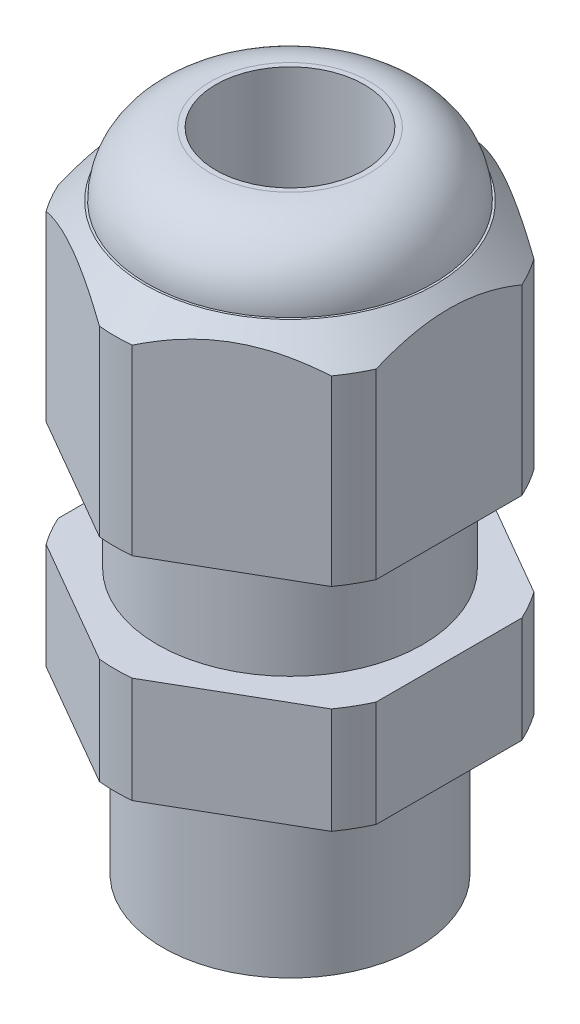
ISO-10303-21;
HEADER;
FILE_DESCRIPTION(('STEP AP214'),'2;1');
FILE_NAME('part.step','',(''),(''),'','','');
FILE_SCHEMA(('AUTOMOTIVE_DESIGN { 1 0 10303 214 1 1 1 1 }'));
ENDSEC;
DATA;
#1=APPLICATION_CONTEXT('core data for automotive mechanical design processes');
#2=APPLICATION_PROTOCOL_DEFINITION('international standard','automotive_design',2000,#1);
#3=PRODUCT_CONTEXT('',#1,'mechanical');
#4=PRODUCT('Part','Part','',(#3));
#5=PRODUCT_RELATED_PRODUCT_CATEGORY('part','',(#4));
#6=PRODUCT_DEFINITION_FORMATION('','',#4);
#7=PRODUCT_DEFINITION_CONTEXT('part definition',#1,'design');
#8=PRODUCT_DEFINITION('design','',#6,#7);
#9=PRODUCT_DEFINITION_SHAPE('','',#8);
#10=(LENGTH_UNIT() NAMED_UNIT(*) SI_UNIT(.MILLI.,.METRE.));
#11=(NAMED_UNIT(*) PLANE_ANGLE_UNIT() SI_UNIT($,.RADIAN.));
#12=(NAMED_UNIT(*) SI_UNIT($,.STERADIAN.) SOLID_ANGLE_UNIT());
#13=UNCERTAINTY_MEASURE_WITH_UNIT(LENGTH_MEASURE(1.E-05),#10,'distance_accuracy_value','');
#14=(GEOMETRIC_REPRESENTATION_CONTEXT(3) GLOBAL_UNCERTAINTY_ASSIGNED_CONTEXT((#13)) GLOBAL_UNIT_ASSIGNED_CONTEXT((#10,
#11,#12)) REPRESENTATION_CONTEXT('',''));
#15=CARTESIAN_POINT('',(0.,0.,0.));
#16=DIRECTION('',(0.,0.,1.));
#17=DIRECTION('',(1.,0.,0.));
#18=AXIS2_PLACEMENT_3D('',#15,#16,#17);
#19=CARTESIAN_POINT('',(-1.66533453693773E-13,0.,0.));
#20=DIRECTION('',(0.,-1.,0.));
#21=DIRECTION('',(0.,0.,-1.));
#22=AXIS2_PLACEMENT_3D('',#19,#20,#21);
#23=CYLINDRICAL_SURFACE('',#22,8.25);
#24=CARTESIAN_POINT('',(0.,17.5000000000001,0.));
#25=DIRECTION('',(0.,-1.,0.));
#26=DIRECTION('',(0.,0.,-1.));
#27=AXIS2_PLACEMENT_3D('',#24,#25,#26);
#28=CIRCLE('',#27,8.25);
#29=CARTESIAN_POINT('',(0.773529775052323,17.5000000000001,8.21365641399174));
#30=VERTEX_POINT('',#29);
#31=CARTESIAN_POINT('',(-0.773529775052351,17.5000000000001,8.21365641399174));
#32=VERTEX_POINT('',#31);
#33=EDGE_CURVE('E355',#30,#32,#28,.T.);
#34=ORIENTED_EDGE('',*,*,#33,.F.);
#35=DIRECTION('',(0.,-1.,0.));
#36=VECTOR('',#35,1.);
#37=CARTESIAN_POINT('',(0.77352977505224,0.,8.21365641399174));
#38=LINE('',#37,#36);
#39=CARTESIAN_POINT('',(0.773529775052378,26.1000000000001,8.21365641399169));
#40=VERTEX_POINT('',#39);
#41=EDGE_CURVE('E399',#30,#40,#38,.F.);
#42=ORIENTED_EDGE('',*,*,#41,.T.);
#43=CARTESIAN_POINT('',(-2.22044604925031E-13,26.1000000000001,0.));
#44=DIRECTION('',(0.,1.,0.));
#45=DIRECTION('',(0.,0.,1.));
#46=AXIS2_PLACEMENT_3D('',#43,#44,#45);
#47=CIRCLE('',#46,8.25);
#48=CARTESIAN_POINT('',(-0.773529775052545,26.1000000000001,8.21365641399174));
#49=VERTEX_POINT('',#48);
#50=EDGE_CURVE('E237',#40,#49,#47,.F.);
#51=ORIENTED_EDGE('',*,*,#50,.T.);
#52=DIRECTION('',(0.,-1.,0.));
#53=VECTOR('',#52,1.);
#54=CARTESIAN_POINT('',(-0.773529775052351,0.,8.21365641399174));
#55=LINE('',#54,#53);
#56=EDGE_CURVE('E422',#49,#32,#55,.T.);
#57=ORIENTED_EDGE('',*,*,#56,.T.);
#58=EDGE_LOOP('',(#34,#42,#51,#57));
#59=FACE_BOUND('',#58,.T.);
#60=ADVANCED_FACE('F44',(#59),#23,.T.);
#61=CARTESIAN_POINT('',(7.49999999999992,26.1,3.43693177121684));
#62=VERTEX_POINT('',#61);
#63=CARTESIAN_POINT('',(6.72647022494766,26.1000000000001,4.7767246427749));
#64=VERTEX_POINT('',#63);
#65=EDGE_CURVE('E229',#62,#64,#47,.F.);
#66=ORIENTED_EDGE('',*,*,#65,.T.);
#67=DIRECTION('',(0.,-1.,0.));
#68=VECTOR('',#67,1.);
#69=CARTESIAN_POINT('',(6.72647022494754,0.,4.77672464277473));
#70=LINE('',#69,#68);
#71=CARTESIAN_POINT('',(6.72647022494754,17.5000000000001,4.7767246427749));
#72=VERTEX_POINT('',#71);
#73=EDGE_CURVE('E402',#64,#72,#70,.T.);
#74=ORIENTED_EDGE('',*,*,#73,.T.);
#75=CARTESIAN_POINT('',(7.50000000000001,17.5,3.43693177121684));
#76=VERTEX_POINT('',#75);
#77=EDGE_CURVE('E231',#76,#72,#28,.T.);
#78=ORIENTED_EDGE('',*,*,#77,.F.);
#79=DIRECTION('',(0.,-1.,0.));
#80=VECTOR('',#79,1.);
#81=CARTESIAN_POINT('',(7.49999999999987,0.,3.43693177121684));
#82=LINE('',#81,#80);
#83=EDGE_CURVE('E213',#76,#62,#82,.F.);
#84=ORIENTED_EDGE('',*,*,#83,.T.);
#85=EDGE_LOOP('',(#66,#74,#78,#84));
#86=FACE_BOUND('',#85,.T.);
#87=ADVANCED_FACE('F227',(#86),#23,.T.);
#88=CARTESIAN_POINT('',(-6.72647022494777,17.5000000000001,4.7767246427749));
#89=VERTEX_POINT('',#88);
#90=CARTESIAN_POINT('',(-7.50000000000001,17.5000000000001,3.43693177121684));
#91=VERTEX_POINT('',#90);
#92=EDGE_CURVE('E363',#89,#91,#28,.T.);
#93=ORIENTED_EDGE('',*,*,#92,.F.);
#94=DIRECTION('',(0.,-1.,0.));
#95=VECTOR('',#94,1.);
#96=CARTESIAN_POINT('',(-6.72647022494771,0.,4.7767246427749));
#97=LINE('',#96,#95);
#98=CARTESIAN_POINT('',(-6.72647022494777,26.1000000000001,4.77672464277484));
#99=VERTEX_POINT('',#98);
#100=EDGE_CURVE('E419',#89,#99,#97,.F.);
#101=ORIENTED_EDGE('',*,*,#100,.T.);
#102=CARTESIAN_POINT('',(-7.50000000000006,26.1000000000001,3.43693177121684));
#103=VERTEX_POINT('',#102);
#104=EDGE_CURVE('E242',#99,#103,#47,.F.);
#105=ORIENTED_EDGE('',*,*,#104,.T.);
#106=DIRECTION('',(0.,-1.,0.));
#107=VECTOR('',#106,1.);
#108=CARTESIAN_POINT('',(-7.50000000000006,0.,3.43693177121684));
#109=LINE('',#108,#107);
#110=EDGE_CURVE('E440',#103,#91,#109,.T.);
#111=ORIENTED_EDGE('',*,*,#110,.T.);
#112=EDGE_LOOP('',(#93,#101,#105,#111));
#113=FACE_BOUND('',#112,.T.);
#114=ADVANCED_FACE('F326',(#113),#23,.T.);
#115=CARTESIAN_POINT('',(-7.50000000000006,17.5000000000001,-3.43693177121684));
#116=VERTEX_POINT('',#115);
#117=CARTESIAN_POINT('',(-6.72647022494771,17.5,-4.7767246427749));
#118=VERTEX_POINT('',#117);
#119=EDGE_CURVE('E358',#116,#118,#28,.T.);
#120=ORIENTED_EDGE('',*,*,#119,.F.);
#121=DIRECTION('',(0.,-1.,0.));
#122=VECTOR('',#121,1.);
#123=CARTESIAN_POINT('',(-7.50000000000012,0.,-3.43693177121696));
#124=LINE('',#123,#122);
#125=CARTESIAN_POINT('',(-7.50000000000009,26.1000000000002,-3.43693177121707));
#126=VERTEX_POINT('',#125);
#127=EDGE_CURVE('E437',#116,#126,#124,.F.);
#128=ORIENTED_EDGE('',*,*,#127,.T.);
#129=CARTESIAN_POINT('',(-6.72647022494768,26.1,-4.77672464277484));
#130=VERTEX_POINT('',#129);
#131=EDGE_CURVE('E503',#126,#130,#47,.F.);
#132=ORIENTED_EDGE('',*,*,#131,.T.);
#133=DIRECTION('',(0.,-1.,0.));
#134=VECTOR('',#133,1.);
#135=CARTESIAN_POINT('',(-6.72647022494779,0.,-4.77672464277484));
#136=LINE('',#135,#134);
#137=EDGE_CURVE('E457',#130,#118,#136,.T.);
#138=ORIENTED_EDGE('',*,*,#137,.T.);
#139=EDGE_LOOP('',(#120,#128,#132,#138));
#140=FACE_BOUND('',#139,.T.);
#141=ADVANCED_FACE('F340',(#140),#23,.T.);
#142=CARTESIAN_POINT('',(-0.773529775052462,17.5,-8.21365641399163));
#143=VERTEX_POINT('',#142);
#144=CARTESIAN_POINT('',(0.77352977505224,17.5000000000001,-8.21365641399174));
#145=VERTEX_POINT('',#144);
#146=EDGE_CURVE('E351',#143,#145,#28,.T.);
#147=ORIENTED_EDGE('',*,*,#146,.F.);
#148=DIRECTION('',(0.,-1.,0.));
#149=VECTOR('',#148,1.);
#150=CARTESIAN_POINT('',(-0.773529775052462,0.,-8.21365641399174));
#151=LINE('',#150,#149);
#152=CARTESIAN_POINT('',(-0.773529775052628,26.1000000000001,-8.21365641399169));
#153=VERTEX_POINT('',#152);
#154=EDGE_CURVE('E454',#143,#153,#151,.F.);
#155=ORIENTED_EDGE('',*,*,#154,.T.);
#156=CARTESIAN_POINT('',(0.773529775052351,26.1,-8.21365641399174));
#157=VERTEX_POINT('',#156);
#158=EDGE_CURVE('E239',#153,#157,#47,.F.);
#159=ORIENTED_EDGE('',*,*,#158,.T.);
#160=DIRECTION('',(0.,-1.,0.));
#161=VECTOR('',#160,1.);
#162=CARTESIAN_POINT('',(0.773529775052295,0.,-8.21365641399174));
#163=LINE('',#162,#161);
#164=EDGE_CURVE('E475',#157,#145,#163,.T.);
#165=ORIENTED_EDGE('',*,*,#164,.T.);
#166=EDGE_LOOP('',(#147,#155,#159,#165));
#167=FACE_BOUND('',#166,.T.);
#168=ADVANCED_FACE('F332',(#167),#23,.T.);
#169=CARTESIAN_POINT('',(6.72647022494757,17.5,-4.77672464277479));
#170=VERTEX_POINT('',#169);
#171=CARTESIAN_POINT('',(7.50000000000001,17.5,-3.43693177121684));
#172=VERTEX_POINT('',#171);
#173=EDGE_CURVE('E345',#170,#172,#28,.T.);
#174=ORIENTED_EDGE('',*,*,#173,.F.);
#175=DIRECTION('',(0.,-1.,0.));
#176=VECTOR('',#175,1.);
#177=CARTESIAN_POINT('',(6.72647022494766,0.,-4.7767246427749));
#178=LINE('',#177,#176);
#179=CARTESIAN_POINT('',(6.72647022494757,26.1000000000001,-4.7767246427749));
#180=VERTEX_POINT('',#179);
#181=EDGE_CURVE('E346',#170,#180,#178,.F.);
#182=ORIENTED_EDGE('',*,*,#181,.T.);
#183=CARTESIAN_POINT('',(7.49999999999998,26.1,-3.43693177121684));
#184=VERTEX_POINT('',#183);
#185=EDGE_CURVE('E236',#180,#184,#47,.F.);
#186=ORIENTED_EDGE('',*,*,#185,.T.);
#187=DIRECTION('',(0.,-1.,0.));
#188=VECTOR('',#187,1.);
#189=CARTESIAN_POINT('',(7.49999999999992,0.,-3.43693177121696));
#190=LINE('',#189,#188);
#191=EDGE_CURVE('E216',#184,#172,#190,.T.);
#192=ORIENTED_EDGE('',*,*,#191,.T.);
#193=EDGE_LOOP('',(#174,#182,#186,#192));
#194=FACE_BOUND('',#193,.T.);
#195=ADVANCED_FACE('F322',(#194),#23,.T.);
#196=CARTESIAN_POINT('',(6.24999999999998,17.5,0.));
#197=DIRECTION('',(0.,-1.,0.));
#198=DIRECTION('',(0.,0.,-1.));
#199=AXIS2_PLACEMENT_3D('',#196,#197,#198);
#200=PLANE('',#199);
#201=CARTESIAN_POINT('',(0.,17.5000000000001,0.));
#202=DIRECTION('',(0.,-1.,0.));
#203=DIRECTION('',(0.,0.,-1.));
#204=AXIS2_PLACEMENT_3D('',#201,#202,#203);
#205=CIRCLE('',#204,6.25);
#206=CARTESIAN_POINT('',(0.,17.5000000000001,-6.25));
#207=VERTEX_POINT('',#206);
#208=EDGE_CURVE('E359',#207,#207,#205,.T.);
#209=ORIENTED_EDGE('',*,*,#208,.F.);
#210=EDGE_LOOP('',(#209));
#211=FACE_BOUND('',#210,.T.);
#212=ORIENTED_EDGE('',*,*,#77,.T.);
#213=DIRECTION('',(-0.866025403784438,0.,0.5));
#214=VECTOR('',#213,1.);
#215=CARTESIAN_POINT('',(8.43749999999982,17.5,3.78886114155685));
#216=LINE('',#215,#214);
#217=EDGE_CURVE('E396',#72,#30,#216,.T.);
#218=ORIENTED_EDGE('',*,*,#217,.T.);
#219=ORIENTED_EDGE('',*,*,#33,.T.);
#220=DIRECTION('',(-0.866025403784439,0.,-0.5));
#221=VECTOR('',#220,1.);
#222=CARTESIAN_POINT('',(0.937499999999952,17.5,9.20151991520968));
#223=LINE('',#222,#221);
#224=EDGE_CURVE('E416',#32,#89,#223,.T.);
#225=ORIENTED_EDGE('',*,*,#224,.T.);
#226=ORIENTED_EDGE('',*,*,#92,.T.);
#227=DIRECTION('',(0.,0.,-1.));
#228=VECTOR('',#227,1.);
#229=CARTESIAN_POINT('',(-7.50000000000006,17.5000000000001,0.));
#230=LINE('',#229,#228);
#231=EDGE_CURVE('E434',#91,#116,#230,.T.);
#232=ORIENTED_EDGE('',*,*,#231,.T.);
#233=ORIENTED_EDGE('',*,*,#119,.T.);
#234=DIRECTION('',(0.866025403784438,0.,-0.5));
#235=VECTOR('',#234,1.);
#236=CARTESIAN_POINT('',(0.937499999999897,17.5000000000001,-9.20151991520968));
#237=LINE('',#236,#235);
#238=EDGE_CURVE('E452',#118,#143,#237,.T.);
#239=ORIENTED_EDGE('',*,*,#238,.T.);
#240=ORIENTED_EDGE('',*,*,#146,.T.);
#241=DIRECTION('',(0.866025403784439,0.,0.5));
#242=VECTOR('',#241,1.);
#243=CARTESIAN_POINT('',(8.43749999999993,17.5000000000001,-3.78886114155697));
#244=LINE('',#243,#242);
#245=EDGE_CURVE('E472',#145,#170,#244,.T.);
#246=ORIENTED_EDGE('',*,*,#245,.T.);
#247=ORIENTED_EDGE('',*,*,#173,.T.);
#248=DIRECTION('',(0.,0.,1.));
#249=VECTOR('',#248,1.);
#250=CARTESIAN_POINT('',(7.49999999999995,17.5000000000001,0.));
#251=LINE('',#250,#249);
#252=EDGE_CURVE('E232',#172,#76,#251,.T.);
#253=ORIENTED_EDGE('',*,*,#252,.T.);
#254=EDGE_LOOP('',(#212,#218,#219,#225,#226,#232,#233,#239,#240,#246,#247,#253));
#255=FACE_BOUND('',#254,.T.);
#256=ADVANCED_FACE('F331',(#211,#255),#200,.T.);
#257=CARTESIAN_POINT('',(8.24999999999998,12.5000000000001,0.));
#258=DIRECTION('',(0.,1.,0.));
#259=DIRECTION('',(0.,0.,1.));
#260=AXIS2_PLACEMENT_3D('',#257,#258,#259);
#261=PLANE('',#260);
#262=CARTESIAN_POINT('',(-1.11022302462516E-13,12.5000000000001,0.));
#263=DIRECTION('',(0.,-1.,0.));
#264=DIRECTION('',(0.,0.,-1.));
#265=AXIS2_PLACEMENT_3D('',#262,#263,#264);
#266=CIRCLE('',#265,6.25);
#267=CARTESIAN_POINT('',(-1.14318277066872E-13,12.5000000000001,-6.25));
#268=VERTEX_POINT('',#267);
#269=EDGE_CURVE('E365',#268,#268,#266,.T.);
#270=ORIENTED_EDGE('',*,*,#269,.T.);
#271=EDGE_LOOP('',(#270));
#272=FACE_BOUND('',#271,.T.);
#273=CARTESIAN_POINT('',(-1.11022302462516E-13,12.5000000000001,0.));
#274=DIRECTION('',(0.,-1.,0.));
#275=DIRECTION('',(0.,0.,-1.));
#276=AXIS2_PLACEMENT_3D('',#273,#274,#275);
#277=CIRCLE('',#276,8.25);
#278=CARTESIAN_POINT('',(0.77352977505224,12.5000000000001,8.21365641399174));
#279=VERTEX_POINT('',#278);
#280=CARTESIAN_POINT('',(-0.773529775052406,12.5000000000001,8.21365641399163));
#281=VERTEX_POINT('',#280);
#282=EDGE_CURVE('E641',#279,#281,#277,.T.);
#283=ORIENTED_EDGE('',*,*,#282,.F.);
#284=DIRECTION('',(0.866025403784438,0.,-0.5));
#285=VECTOR('',#284,1.);
#286=CARTESIAN_POINT('',(9.93749999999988,12.5000000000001,2.92283573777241));
#287=LINE('',#286,#285);
#288=CARTESIAN_POINT('',(6.72647022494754,12.5000000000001,4.7767246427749));
#289=VERTEX_POINT('',#288);
#290=EDGE_CURVE('E384',#279,#289,#287,.T.);
#291=ORIENTED_EDGE('',*,*,#290,.T.);
#292=CARTESIAN_POINT('',(7.49999999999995,12.5000000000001,3.43693177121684));
#293=VERTEX_POINT('',#292);
#294=EDGE_CURVE('E639',#293,#289,#277,.T.);
#295=ORIENTED_EDGE('',*,*,#294,.F.);
#296=DIRECTION('',(0.,0.,-1.));
#297=VECTOR('',#296,1.);
#298=CARTESIAN_POINT('',(7.50000000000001,12.5000000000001,0.));
#299=LINE('',#298,#297);
#300=CARTESIAN_POINT('',(7.49999999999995,12.5000000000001,-3.43693177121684));
#301=VERTEX_POINT('',#300);
#302=EDGE_CURVE('E478',#293,#301,#299,.T.);
#303=ORIENTED_EDGE('',*,*,#302,.T.);
#304=CARTESIAN_POINT('',(6.72647022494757,12.5000000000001,-4.77672464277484));
#305=VERTEX_POINT('',#304);
#306=EDGE_CURVE('E369',#305,#301,#277,.T.);
#307=ORIENTED_EDGE('',*,*,#306,.F.);
#308=DIRECTION('',(-0.866025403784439,0.,-0.5));
#309=VECTOR('',#308,1.);
#310=CARTESIAN_POINT('',(9.93749999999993,12.5000000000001,-2.92283573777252));
#311=LINE('',#310,#309);
#312=CARTESIAN_POINT('',(0.773529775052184,12.5000000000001,-8.21365641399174));
#313=VERTEX_POINT('',#312);
#314=EDGE_CURVE('E460',#305,#313,#311,.T.);
#315=ORIENTED_EDGE('',*,*,#314,.T.);
#316=CARTESIAN_POINT('',(-0.773529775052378,12.5,-8.21365641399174));
#317=VERTEX_POINT('',#316);
#318=EDGE_CURVE('E372',#317,#313,#277,.T.);
#319=ORIENTED_EDGE('',*,*,#318,.F.);
#320=DIRECTION('',(-0.866025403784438,0.,0.5));
#321=VECTOR('',#320,1.);
#322=CARTESIAN_POINT('',(2.43749999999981,12.5,-10.0675453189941));
#323=LINE('',#322,#321);
#324=CARTESIAN_POINT('',(-6.72647022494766,12.5000000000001,-4.7767246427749));
#325=VERTEX_POINT('',#324);
#326=EDGE_CURVE('E443',#317,#325,#323,.T.);
#327=ORIENTED_EDGE('',*,*,#326,.T.);
#328=CARTESIAN_POINT('',(-7.50000000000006,12.5000000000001,-3.43693177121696));
#329=VERTEX_POINT('',#328);
#330=EDGE_CURVE('E375',#329,#325,#277,.T.);
#331=ORIENTED_EDGE('',*,*,#330,.F.);
#332=DIRECTION('',(0.,0.,1.));
#333=VECTOR('',#332,1.);
#334=CARTESIAN_POINT('',(-7.50000000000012,12.5000000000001,0.));
#335=LINE('',#334,#333);
#336=CARTESIAN_POINT('',(-7.50000000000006,12.5000000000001,3.43693177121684));
#337=VERTEX_POINT('',#336);
#338=EDGE_CURVE('E425',#329,#337,#335,.T.);
#339=ORIENTED_EDGE('',*,*,#338,.T.);
#340=CARTESIAN_POINT('',(-6.72647022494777,12.5000000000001,4.77672464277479));
#341=VERTEX_POINT('',#340);
#342=EDGE_CURVE('E642',#341,#337,#277,.T.);
#343=ORIENTED_EDGE('',*,*,#342,.F.);
#344=DIRECTION('',(0.866025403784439,0.,0.5));
#345=VECTOR('',#344,1.);
#346=CARTESIAN_POINT('',(2.43749999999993,12.5000000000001,10.0675453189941));
#347=LINE('',#346,#345);
#348=EDGE_CURVE('E404',#341,#281,#347,.T.);
#349=ORIENTED_EDGE('',*,*,#348,.T.);
#350=EDGE_LOOP('',(#283,#291,#295,#303,#307,#315,#319,#327,#331,#339,#343,#349));
#351=FACE_BOUND('',#350,.T.);
#352=ADVANCED_FACE('F338',(#272,#351),#261,.T.);
#353=CARTESIAN_POINT('',(-1.66533453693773E-13,0.,0.));
#354=DIRECTION('',(0.,-1.,0.));
#355=DIRECTION('',(0.,0.,-1.));
#356=AXIS2_PLACEMENT_3D('',#353,#354,#355);
#357=CYLINDRICAL_SURFACE('',#356,8.25);
#358=CARTESIAN_POINT('',(-1.66533453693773E-13,7.50000000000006,0.));
#359=DIRECTION('',(0.,-1.,0.));
#360=DIRECTION('',(0.,0.,-1.));
#361=AXIS2_PLACEMENT_3D('',#358,#359,#360);
#362=CIRCLE('',#361,8.25);
#363=CARTESIAN_POINT('',(0.773529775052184,7.5000000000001,8.21365641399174));
#364=VERTEX_POINT('',#363);
#365=CARTESIAN_POINT('',(-0.773529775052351,7.50000000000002,8.21365641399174));
#366=VERTEX_POINT('',#365);
#367=EDGE_CURVE('E613',#364,#366,#362,.T.);
#368=ORIENTED_EDGE('',*,*,#367,.F.);
#369=DIRECTION('',(0.,-1.,0.));
#370=VECTOR('',#369,1.);
#371=CARTESIAN_POINT('',(0.77352977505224,0.,8.21365641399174));
#372=LINE('',#371,#370);
#373=EDGE_CURVE('E387',#364,#279,#372,.F.);
#374=ORIENTED_EDGE('',*,*,#373,.T.);
#375=ORIENTED_EDGE('',*,*,#282,.T.);
#376=DIRECTION('',(0.,-1.,0.));
#377=VECTOR('',#376,1.);
#378=CARTESIAN_POINT('',(-0.773529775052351,0.,8.21365641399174));
#379=LINE('',#378,#377);
#380=EDGE_CURVE('E410',#281,#366,#379,.T.);
#381=ORIENTED_EDGE('',*,*,#380,.T.);
#382=EDGE_LOOP('',(#368,#374,#375,#381));
#383=FACE_BOUND('',#382,.T.);
#384=ADVANCED_FACE('F616',(#383),#357,.T.);
#385=ORIENTED_EDGE('',*,*,#294,.T.);
#386=DIRECTION('',(0.,-1.,0.));
#387=VECTOR('',#386,1.);
#388=CARTESIAN_POINT('',(6.72647022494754,0.,4.77672464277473));
#389=LINE('',#388,#387);
#390=CARTESIAN_POINT('',(6.72647022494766,7.50000000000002,4.77672464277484));
#391=VERTEX_POINT('',#390);
#392=EDGE_CURVE('E390',#289,#391,#389,.T.);
#393=ORIENTED_EDGE('',*,*,#392,.T.);
#394=CARTESIAN_POINT('',(7.49999999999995,7.50000000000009,3.4369317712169));
#395=VERTEX_POINT('',#394);
#396=EDGE_CURVE('E615',#395,#391,#362,.T.);
#397=ORIENTED_EDGE('',*,*,#396,.F.);
#398=DIRECTION('',(0.,-1.,0.));
#399=VECTOR('',#398,1.);
#400=CARTESIAN_POINT('',(7.49999999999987,0.,3.43693177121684));
#401=LINE('',#400,#399);
#402=EDGE_CURVE('E481',#395,#293,#401,.F.);
#403=ORIENTED_EDGE('',*,*,#402,.T.);
#404=EDGE_LOOP('',(#385,#393,#397,#403));
#405=FACE_BOUND('',#404,.T.);
#406=ADVANCED_FACE('F648',(#405),#357,.T.);
#407=CARTESIAN_POINT('',(-6.72647022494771,7.50000000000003,4.77672464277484));
#408=VERTEX_POINT('',#407);
#409=CARTESIAN_POINT('',(-7.50000000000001,7.50000000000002,3.4369317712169));
#410=VERTEX_POINT('',#409);
#411=EDGE_CURVE('E617',#408,#410,#362,.T.);
#412=ORIENTED_EDGE('',*,*,#411,.F.);
#413=DIRECTION('',(0.,-1.,0.));
#414=VECTOR('',#413,1.);
#415=CARTESIAN_POINT('',(-6.72647022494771,0.,4.7767246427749));
#416=LINE('',#415,#414);
#417=EDGE_CURVE('E407',#408,#341,#416,.F.);
#418=ORIENTED_EDGE('',*,*,#417,.T.);
#419=ORIENTED_EDGE('',*,*,#342,.T.);
#420=DIRECTION('',(0.,-1.,0.));
#421=VECTOR('',#420,1.);
#422=CARTESIAN_POINT('',(-7.50000000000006,0.,3.43693177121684));
#423=LINE('',#422,#421);
#424=EDGE_CURVE('E429',#337,#410,#423,.T.);
#425=ORIENTED_EDGE('',*,*,#424,.T.);
#426=EDGE_LOOP('',(#412,#418,#419,#425));
#427=FACE_BOUND('',#426,.T.);
#428=ADVANCED_FACE('F646',(#427),#357,.T.);
#429=CARTESIAN_POINT('',(-7.50000000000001,7.50000000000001,-3.43693177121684));
#430=VERTEX_POINT('',#429);
#431=CARTESIAN_POINT('',(-6.72647022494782,7.50000000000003,-4.77672464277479));
#432=VERTEX_POINT('',#431);
#433=EDGE_CURVE('E380',#430,#432,#362,.T.);
#434=ORIENTED_EDGE('',*,*,#433,.F.);
#435=DIRECTION('',(0.,-1.,0.));
#436=VECTOR('',#435,1.);
#437=CARTESIAN_POINT('',(-7.50000000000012,0.,-3.43693177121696));
#438=LINE('',#437,#436);
#439=EDGE_CURVE('E73',#430,#329,#438,.F.);
#440=ORIENTED_EDGE('',*,*,#439,.T.);
#441=ORIENTED_EDGE('',*,*,#330,.T.);
#442=DIRECTION('',(0.,-1.,0.));
#443=VECTOR('',#442,1.);
#444=CARTESIAN_POINT('',(-6.72647022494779,0.,-4.77672464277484));
#445=LINE('',#444,#443);
#446=EDGE_CURVE('E447',#325,#432,#445,.T.);
#447=ORIENTED_EDGE('',*,*,#446,.T.);
#448=EDGE_LOOP('',(#434,#440,#441,#447));
#449=FACE_BOUND('',#448,.T.);
#450=ADVANCED_FACE('F624',(#449),#357,.T.);
#451=CARTESIAN_POINT('',(-0.773529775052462,7.50000000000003,-8.21365641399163));
#452=VERTEX_POINT('',#451);
#453=CARTESIAN_POINT('',(0.773529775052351,7.50000000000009,-8.21365641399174));
#454=VERTEX_POINT('',#453);
#455=EDGE_CURVE('E377',#452,#454,#362,.T.);
#456=ORIENTED_EDGE('',*,*,#455,.F.);
#457=DIRECTION('',(0.,-1.,0.));
#458=VECTOR('',#457,1.);
#459=CARTESIAN_POINT('',(-0.773529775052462,0.,-8.21365641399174));
#460=LINE('',#459,#458);
#461=EDGE_CURVE('E65',#452,#317,#460,.F.);
#462=ORIENTED_EDGE('',*,*,#461,.T.);
#463=ORIENTED_EDGE('',*,*,#318,.T.);
#464=DIRECTION('',(0.,-1.,0.));
#465=VECTOR('',#464,1.);
#466=CARTESIAN_POINT('',(0.773529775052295,0.,-8.21365641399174));
#467=LINE('',#466,#465);
#468=EDGE_CURVE('E466',#313,#454,#467,.T.);
#469=ORIENTED_EDGE('',*,*,#468,.T.);
#470=EDGE_LOOP('',(#456,#462,#463,#469));
#471=FACE_BOUND('',#470,.T.);
#472=ADVANCED_FACE('F631',(#471),#357,.T.);
#473=CARTESIAN_POINT('',(6.72647022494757,7.5000000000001,-4.7767246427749));
#474=VERTEX_POINT('',#473);
#475=CARTESIAN_POINT('',(7.49999999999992,7.50000000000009,-3.4369317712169));
#476=VERTEX_POINT('',#475);
#477=EDGE_CURVE('E376',#474,#476,#362,.T.);
#478=ORIENTED_EDGE('',*,*,#477,.F.);
#479=DIRECTION('',(0.,-1.,0.));
#480=VECTOR('',#479,1.);
#481=CARTESIAN_POINT('',(6.72647022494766,0.,-4.7767246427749));
#482=LINE('',#481,#480);
#483=EDGE_CURVE('E463',#474,#305,#482,.F.);
#484=ORIENTED_EDGE('',*,*,#483,.T.);
#485=ORIENTED_EDGE('',*,*,#306,.T.);
#486=DIRECTION('',(0.,-1.,0.));
#487=VECTOR('',#486,1.);
#488=CARTESIAN_POINT('',(7.49999999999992,0.,-3.43693177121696));
#489=LINE('',#488,#487);
#490=EDGE_CURVE('E484',#301,#476,#489,.T.);
#491=ORIENTED_EDGE('',*,*,#490,.T.);
#492=EDGE_LOOP('',(#478,#484,#485,#491));
#493=FACE_BOUND('',#492,.T.);
#494=ADVANCED_FACE('F635',(#493),#357,.T.);
#495=CARTESIAN_POINT('',(6.00000000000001,7.50000000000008,0.));
#496=DIRECTION('',(0.,-1.,0.));
#497=DIRECTION('',(0.,0.,-1.));
#498=AXIS2_PLACEMENT_3D('',#495,#496,#497);
#499=PLANE('',#498);
#500=CARTESIAN_POINT('',(-1.66533453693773E-13,7.50000000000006,0.));
#501=DIRECTION('',(0.,-1.,0.));
#502=DIRECTION('',(0.,0.,-1.));
#503=AXIS2_PLACEMENT_3D('',#500,#501,#502);
#504=CIRCLE('',#503,6.);
#505=CARTESIAN_POINT('',(-1.69697589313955E-13,7.50000000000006,-5.99999999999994));
#506=VERTEX_POINT('',#505);
#507=EDGE_CURVE('E381',#506,#506,#504,.T.);
#508=ORIENTED_EDGE('',*,*,#507,.F.);
#509=EDGE_LOOP('',(#508));
#510=FACE_BOUND('',#509,.T.);
#511=ORIENTED_EDGE('',*,*,#396,.T.);
#512=DIRECTION('',(-0.866025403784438,0.,0.5));
#513=VECTOR('',#512,1.);
#514=CARTESIAN_POINT('',(8.24999999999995,7.50000000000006,3.89711431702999));
#515=LINE('',#514,#513);
#516=EDGE_CURVE('E393',#391,#364,#515,.T.);
#517=ORIENTED_EDGE('',*,*,#516,.T.);
#518=ORIENTED_EDGE('',*,*,#367,.T.);
#519=DIRECTION('',(-0.866025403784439,0.,-0.5));
#520=VECTOR('',#519,1.);
#521=CARTESIAN_POINT('',(0.749999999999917,7.50000000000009,9.09326673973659));
#522=LINE('',#521,#520);
#523=EDGE_CURVE('E413',#366,#408,#522,.T.);
#524=ORIENTED_EDGE('',*,*,#523,.T.);
#525=ORIENTED_EDGE('',*,*,#411,.T.);
#526=DIRECTION('',(0.,0.,-1.));
#527=VECTOR('',#526,1.);
#528=CARTESIAN_POINT('',(-7.50000000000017,7.50000000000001,0.));
#529=LINE('',#528,#527);
#530=EDGE_CURVE('E432',#410,#430,#529,.T.);
#531=ORIENTED_EDGE('',*,*,#530,.T.);
#532=ORIENTED_EDGE('',*,*,#433,.T.);
#533=DIRECTION('',(0.866025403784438,0.,-0.5));
#534=VECTOR('',#533,1.);
#535=CARTESIAN_POINT('',(0.750000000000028,7.50000000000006,-9.09326673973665));
#536=LINE('',#535,#534);
#537=EDGE_CURVE('E450',#432,#452,#536,.T.);
#538=ORIENTED_EDGE('',*,*,#537,.T.);
#539=ORIENTED_EDGE('',*,*,#455,.T.);
#540=DIRECTION('',(0.866025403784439,0.,0.5));
#541=VECTOR('',#540,1.);
#542=CARTESIAN_POINT('',(8.24999999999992,7.50000000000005,-3.89711431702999));
#543=LINE('',#542,#541);
#544=EDGE_CURVE('E469',#454,#474,#543,.T.);
#545=ORIENTED_EDGE('',*,*,#544,.T.);
#546=ORIENTED_EDGE('',*,*,#477,.T.);
#547=DIRECTION('',(0.,0.,1.));
#548=VECTOR('',#547,1.);
#549=CARTESIAN_POINT('',(7.49999999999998,7.50000000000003,0.));
#550=LINE('',#549,#548);
#551=EDGE_CURVE('E487',#476,#395,#550,.T.);
#552=ORIENTED_EDGE('',*,*,#551,.T.);
#553=EDGE_LOOP('',(#511,#517,#518,#524,#525,#531,#532,#538,#539,#545,#546,#552));
#554=FACE_BOUND('',#553,.T.);
#555=ADVANCED_FACE('F263',(#510,#554),#499,.T.);
#556=CARTESIAN_POINT('',(-2.22044604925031E-13,26.1000000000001,0.));
#557=DIRECTION('',(0.,-1.,0.));
#558=DIRECTION('',(0.,0.,-1.));
#559=AXIS2_PLACEMENT_3D('',#556,#557,#558);
#560=CONICAL_SURFACE('',#559,8.25,0.78539816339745);
#561=CARTESIAN_POINT('',(-2.4980018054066E-13,27.5000000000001,0.));
#562=DIRECTION('',(0.,1.,0.));
#563=DIRECTION('',(0.,0.,1.));
#564=AXIS2_PLACEMENT_3D('',#561,#562,#563);
#565=CIRCLE('',#564,6.85);
#566=CARTESIAN_POINT('',(-2.46187792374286E-13,27.5000000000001,6.85));
#567=VERTEX_POINT('',#566);
#568=EDGE_CURVE('E222',#567,#567,#565,.T.);
#569=ORIENTED_EDGE('',*,*,#568,.F.);
#570=EDGE_LOOP('',(#569));
#571=FACE_BOUND('',#570,.T.);
#572=ORIENTED_EDGE('',*,*,#50,.F.);
#573=CARTESIAN_POINT('',(0.773114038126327,26.0998000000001,8.21389643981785));
#574=CARTESIAN_POINT('',(0.992423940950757,26.2053259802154,8.08727780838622));
#575=CARTESIAN_POINT('',(1.21495940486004,26.3027449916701,7.95879689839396));
#576=CARTESIAN_POINT('',(1.6666007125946,26.4774565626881,7.69804166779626));
#577=CARTESIAN_POINT('',(1.89572474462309,26.5546859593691,7.56575684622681));
#578=CARTESIAN_POINT('',(2.35701094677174,26.6837609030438,7.29943313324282));
#579=CARTESIAN_POINT('',(2.58912079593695,26.7358495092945,7.16542444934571));
#580=CARTESIAN_POINT('',(3.056521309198,26.8120926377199,6.89557063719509));
#581=CARTESIAN_POINT('',(3.29180744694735,26.8362833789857,6.75972812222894));
#582=CARTESIAN_POINT('',(3.75117733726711,26.8544431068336,6.49451079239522));
#583=CARTESIAN_POINT('',(3.97521686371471,26.8498981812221,6.36516151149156));
#584=CARTESIAN_POINT('',(4.42180084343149,26.8143825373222,6.10732613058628));
#585=CARTESIAN_POINT('',(4.64434450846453,26.7833988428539,5.97884048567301));
#586=CARTESIAN_POINT('',(5.08564592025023,26.6971899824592,5.72405499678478));
#587=CARTESIAN_POINT('',(5.3044061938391,26.6419817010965,5.59775369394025));
#588=CARTESIAN_POINT('',(5.73713686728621,26.510562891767,5.34791652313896));
#589=CARTESIAN_POINT('',(5.95110617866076,26.4343476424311,5.22438128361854));
#590=CARTESIAN_POINT('',(6.25765618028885,26.3111068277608,5.04739455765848));
#591=CARTESIAN_POINT('',(6.35238999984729,26.2710268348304,4.99269996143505));
#592=CARTESIAN_POINT('',(6.5405514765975,26.1877163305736,4.8840648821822));
#593=CARTESIAN_POINT('',(6.63398173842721,26.1444936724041,4.83012289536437));
#594=CARTESIAN_POINT('',(6.72688596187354,26.0998000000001,4.7764846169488));
#595=B_SPLINE_CURVE_WITH_KNOTS('',3,(#573,#574,#575,#576,#577,#578,#579,#580,#581,#582,#583,
#584,#585,#586,#587,#588,#589,#590,#591,#592,#593,#594),.UNSPECIFIED.,.F.,.F.,(4,2,2,2,2,2,2,2,
2,2,4),(0.,0.823374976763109,1.64929584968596,2.46706335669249,3.28376797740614,
4.05859407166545,4.83380067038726,5.60846780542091,6.38330919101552,6.73277180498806,
7.08138932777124),.UNSPECIFIED.);
#596=EDGE_CURVE('E12',#40,#64,#595,.T.);
#597=ORIENTED_EDGE('',*,*,#596,.T.);
#598=ORIENTED_EDGE('',*,*,#65,.F.);
#599=CARTESIAN_POINT('',(7.49999999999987,22.9283154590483,-8.61422531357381));
#600=CARTESIAN_POINT('',(7.49999999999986,23.0865447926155,-8.40437976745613));
#601=CARTESIAN_POINT('',(7.49999999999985,23.2432381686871,-8.19335687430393));
#602=CARTESIAN_POINT('',(7.49999999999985,23.5528660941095,-7.76849291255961));
#603=CARTESIAN_POINT('',(7.49999999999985,23.705799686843,-7.55465114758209));
#604=CARTESIAN_POINT('',(7.49999999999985,24.0083082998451,-7.12212180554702));
#605=CARTESIAN_POINT('',(7.49999999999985,24.1578481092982,-6.90340951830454));
#606=CARTESIAN_POINT('',(7.49999999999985,24.451324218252,-6.46226878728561));
#607=CARTESIAN_POINT('',(7.49999999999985,24.5952609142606,-6.23984060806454));
#608=CARTESIAN_POINT('',(7.49999999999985,24.884270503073,-5.77791764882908));
#609=CARTESIAN_POINT('',(7.49999999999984,25.028943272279,-5.53817124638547));
#610=CARTESIAN_POINT('',(7.49999999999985,25.3087392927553,-5.05308465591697));
#611=CARTESIAN_POINT('',(7.49999999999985,25.443861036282,-4.80774359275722));
#612=CARTESIAN_POINT('',(7.49999999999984,25.7016375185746,-4.31149548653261));
#613=CARTESIAN_POINT('',(7.49999999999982,25.8243289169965,-4.06060763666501));
#614=CARTESIAN_POINT('',(7.49999999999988,26.054498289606,-3.55200388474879));
#615=CARTESIAN_POINT('',(7.49999999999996,26.1619831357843,-3.29429112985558));
#616=CARTESIAN_POINT('',(7.49999999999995,26.3501352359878,-2.79240655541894));
#617=CARTESIAN_POINT('',(7.49999999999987,26.4322543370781,-2.54878473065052));
#618=CARTESIAN_POINT('',(7.49999999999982,26.5769448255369,-2.05569471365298));
#619=CARTESIAN_POINT('',(7.49999999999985,26.639514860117,-1.80622611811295));
#620=CARTESIAN_POINT('',(7.49999999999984,26.74080508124,-1.30707098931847));
#621=CARTESIAN_POINT('',(7.49999999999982,26.7799325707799,-1.05746847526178));
#622=CARTESIAN_POINT('',(7.49999999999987,26.833581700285,-0.555619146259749));
#623=CARTESIAN_POINT('',(7.49999999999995,26.8481075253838,-0.303372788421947));
#624=CARTESIAN_POINT('',(7.49999999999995,26.8514835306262,0.192248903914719));
#625=CARTESIAN_POINT('',(7.49999999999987,26.8412345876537,0.435618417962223));
#626=CARTESIAN_POINT('',(7.49999999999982,26.797609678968,0.92026211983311));
#627=CARTESIAN_POINT('',(7.49999999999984,26.7642314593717,1.16153610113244));
#628=CARTESIAN_POINT('',(7.49999999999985,26.675597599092,1.64432133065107));
#629=CARTESIAN_POINT('',(7.49999999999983,26.6199704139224,1.88576327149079));
#630=CARTESIAN_POINT('',(7.49999999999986,26.4897988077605,2.36338908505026));
#631=CARTESIAN_POINT('',(7.49999999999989,26.415255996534,2.59957340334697));
#632=CARTESIAN_POINT('',(7.4999999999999,26.2424697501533,3.08857259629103));
#633=CARTESIAN_POINT('',(7.49999999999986,26.1426429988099,3.34082236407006));
#634=CARTESIAN_POINT('',(7.49999999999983,25.9276702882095,3.8387653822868));
#635=CARTESIAN_POINT('',(7.49999999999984,25.8125171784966,4.08445550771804));
#636=CARTESIAN_POINT('',(7.49999999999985,25.5696321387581,4.57048254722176));
#637=CARTESIAN_POINT('',(7.49999999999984,25.4418606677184,4.81079954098));
#638=CARTESIAN_POINT('',(7.49999999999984,25.1765637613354,5.28590165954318));
#639=CARTESIAN_POINT('',(7.49999999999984,25.0390398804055,5.5206876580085));
#640=CARTESIAN_POINT('',(7.49999999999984,24.7632013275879,5.97389250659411));
#641=CARTESIAN_POINT('',(7.49999999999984,24.6252671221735,6.19254415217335));
#642=CARTESIAN_POINT('',(7.49999999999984,24.3436030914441,6.62609394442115));
#643=CARTESIAN_POINT('',(7.49999999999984,24.1998728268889,6.84099180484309));
#644=CARTESIAN_POINT('',(7.49999999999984,23.9088411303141,7.26578180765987));
#645=CARTESIAN_POINT('',(7.49999999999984,23.7615782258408,7.47570044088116));
#646=CARTESIAN_POINT('',(7.49999999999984,23.4631615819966,7.89266969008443));
#647=CARTESIAN_POINT('',(7.49999999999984,23.3120089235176,8.09972107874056));
#648=CARTESIAN_POINT('',(7.49999999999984,23.1592660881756,8.30557195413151));
#649=B_SPLINE_CURVE_WITH_KNOTS('',3,(#599,#600,#601,#602,#603,#604,#605,#606,#607,#608,#609,
#610,#611,#612,#613,#614,#615,#616,#617,#618,#619,#620,#621,#622,#623,#624,#625,#626,#627,#628,
#629,#630,#631,#632,#633,#634,#635,#636,#637,#638,#639,#640,#641,#642,#643,#644,#645,#646,#647,
#648),.UNSPECIFIED.,.F.,.F.,(4,2,2,2,2,2,2,2,2,2,2,2,2,2,2,2,2,2,2,2,2,2,2,2,4),(0.,
0.788460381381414,1.57711934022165,2.37188989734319,3.16660410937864,4.00647298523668,
4.84647414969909,5.6839210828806,6.52098834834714,7.29157929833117,8.06222356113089,
8.81905764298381,9.57576296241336,10.3053688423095,11.0350458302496,11.7774538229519,
12.5197986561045,13.3330182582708,14.1466186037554,14.9628546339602,15.7789608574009,
16.5544238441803,17.3299457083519,18.09916338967,18.8681695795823),.UNSPECIFIED.);
#650=EDGE_CURVE('E210',#62,#184,#649,.F.);
#651=ORIENTED_EDGE('',*,*,#650,.T.);
#652=ORIENTED_EDGE('',*,*,#185,.F.);
#653=CARTESIAN_POINT('',(6.72688596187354,26.0998000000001,-4.7764846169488));
#654=CARTESIAN_POINT('',(6.5075760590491,26.2053259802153,-4.90310324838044));
#655=CARTESIAN_POINT('',(6.28504059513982,26.30274499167,-5.03158415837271));
#656=CARTESIAN_POINT('',(5.83339928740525,26.477456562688,-5.29233938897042));
#657=CARTESIAN_POINT('',(5.60427525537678,26.554685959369,-5.42462421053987));
#658=CARTESIAN_POINT('',(5.14298905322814,26.6837609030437,-5.69094792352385));
#659=CARTESIAN_POINT('',(4.91087920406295,26.7358495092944,-5.82495660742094));
#660=CARTESIAN_POINT('',(4.44347869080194,26.8120926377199,-6.09481041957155));
#661=CARTESIAN_POINT('',(4.20819255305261,26.8362833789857,-6.23065293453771));
#662=CARTESIAN_POINT('',(3.74882266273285,26.8544431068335,-6.49587026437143));
#663=CARTESIAN_POINT('',(3.52478313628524,26.8498981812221,-6.62521954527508));
#664=CARTESIAN_POINT('',(3.07819915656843,26.8143825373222,-6.88305492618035));
#665=CARTESIAN_POINT('',(2.85565549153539,26.7833988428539,-7.01154057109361));
#666=CARTESIAN_POINT('',(2.41435407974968,26.6971899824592,-7.26632605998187));
#667=CARTESIAN_POINT('',(2.19559380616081,26.6419817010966,-7.39262736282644));
#668=CARTESIAN_POINT('',(1.76286313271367,26.5105628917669,-7.64246453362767));
#669=CARTESIAN_POINT('',(1.54889382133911,26.4343476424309,-7.76599977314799));
#670=CARTESIAN_POINT('',(1.24234381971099,26.3111068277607,-7.94298649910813));
#671=CARTESIAN_POINT('',(1.14761000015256,26.2710268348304,-7.9976810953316));
#672=CARTESIAN_POINT('',(0.95944852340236,26.1877163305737,-8.1063161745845));
#673=CARTESIAN_POINT('',(0.866018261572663,26.1444936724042,-8.16025816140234));
#674=CARTESIAN_POINT('',(0.773114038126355,26.0998000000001,-8.21389643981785));
#675=B_SPLINE_CURVE_WITH_KNOTS('',3,(#653,#654,#655,#656,#657,#658,#659,#660,#661,#662,#663,
#664,#665,#666,#667,#668,#669,#670,#671,#672,#673,#674),.UNSPECIFIED.,.F.,.F.,(4,2,2,2,2,2,2,2,
2,2,4),(0.,0.823374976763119,1.64929584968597,2.46706335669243,3.28376797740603,
4.05859407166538,4.83380067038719,5.60846780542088,6.38330919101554,6.73277180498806,
7.0813893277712),.UNSPECIFIED.);
#676=EDGE_CURVE('E221',#180,#157,#675,.T.);
#677=ORIENTED_EDGE('',*,*,#676,.T.);
#678=ORIENTED_EDGE('',*,*,#158,.F.);
#679=CARTESIAN_POINT('',(-0.773114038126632,26.0998,-8.21389643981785));
#680=CARTESIAN_POINT('',(-0.992423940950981,26.2053259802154,-8.08727780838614));
#681=CARTESIAN_POINT('',(-1.21495940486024,26.3027449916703,-7.95879689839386));
#682=CARTESIAN_POINT('',(-1.66660071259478,26.4774565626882,-7.69804166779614));
#683=CARTESIAN_POINT('',(-1.89572474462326,26.5546859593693,-7.5657568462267));
#684=CARTESIAN_POINT('',(-2.35701094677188,26.683760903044,-7.29943313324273));
#685=CARTESIAN_POINT('',(-2.58912079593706,26.7358495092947,-7.16542444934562));
#686=CARTESIAN_POINT('',(-3.0565213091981,26.8120926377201,-6.89557063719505));
#687=CARTESIAN_POINT('',(-3.29180744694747,26.8362833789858,-6.75972812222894));
#688=CARTESIAN_POINT('',(-3.75117733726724,26.8544431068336,-6.4945107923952));
#689=CARTESIAN_POINT('',(-3.97521686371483,26.8498981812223,-6.3651615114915));
#690=CARTESIAN_POINT('',(-4.4218008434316,26.8143825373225,-6.10732613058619));
#691=CARTESIAN_POINT('',(-4.64434450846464,26.7833988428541,-5.97884048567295));
#692=CARTESIAN_POINT('',(-5.08564592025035,26.6971899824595,-5.7240549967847));
#693=CARTESIAN_POINT('',(-5.30440619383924,26.6419817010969,-5.59775369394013));
#694=CARTESIAN_POINT('',(-5.73713686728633,26.5105628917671,-5.34791652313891));
#695=CARTESIAN_POINT('',(-5.95110617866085,26.4343476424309,-5.22438128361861));
#696=CARTESIAN_POINT('',(-6.257656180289,26.3111068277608,-5.04739455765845));
#697=CARTESIAN_POINT('',(-6.35238999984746,26.2710268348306,-4.99269996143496));
#698=CARTESIAN_POINT('',(-6.54055147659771,26.1877163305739,-4.88406488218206));
#699=CARTESIAN_POINT('',(-6.63398173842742,26.1444936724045,-4.83012289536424));
#700=CARTESIAN_POINT('',(-6.72688596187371,26.0998000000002,-4.7764846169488));
#701=B_SPLINE_CURVE_WITH_KNOTS('',3,(#679,#680,#681,#682,#683,#684,#685,#686,#687,#688,#689,
#690,#691,#692,#693,#694,#695,#696,#697,#698,#699,#700),.UNSPECIFIED.,.F.,.F.,(4,2,2,2,2,2,2,2,
2,2,4),(0.,0.823374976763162,1.64929584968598,2.46706335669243,3.28376797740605,
4.05859407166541,4.8338006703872,5.60846780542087,6.38330919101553,6.73277180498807,
7.08138932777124),.UNSPECIFIED.);
#702=EDGE_CURVE('E274',#153,#130,#701,.T.);
#703=ORIENTED_EDGE('',*,*,#702,.T.);
#704=ORIENTED_EDGE('',*,*,#131,.F.);
#705=CARTESIAN_POINT('',(-7.50000000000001,22.9283154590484,-8.61422531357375));
#706=CARTESIAN_POINT('',(-7.50000000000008,23.0865447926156,-8.40437976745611));
#707=CARTESIAN_POINT('',(-7.50000000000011,23.2432381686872,-8.19335687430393));
#708=CARTESIAN_POINT('',(-7.50000000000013,23.5528660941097,-7.76849291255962));
#709=CARTESIAN_POINT('',(-7.50000000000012,23.7057996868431,-7.5546511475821));
#710=CARTESIAN_POINT('',(-7.50000000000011,24.0083082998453,-7.12212180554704));
#711=CARTESIAN_POINT('',(-7.50000000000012,24.1578481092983,-6.90340951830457));
#712=CARTESIAN_POINT('',(-7.50000000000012,24.4513242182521,-6.46226878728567));
#713=CARTESIAN_POINT('',(-7.50000000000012,24.5952609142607,-6.23984060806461));
#714=CARTESIAN_POINT('',(-7.50000000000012,24.8842705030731,-5.77791764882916));
#715=CARTESIAN_POINT('',(-7.50000000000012,25.0289432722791,-5.53817124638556));
#716=CARTESIAN_POINT('',(-7.50000000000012,25.3087392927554,-5.05308465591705));
#717=CARTESIAN_POINT('',(-7.50000000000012,25.4438610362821,-4.80774359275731));
#718=CARTESIAN_POINT('',(-7.50000000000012,25.7016375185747,-4.3114954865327));
#719=CARTESIAN_POINT('',(-7.50000000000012,25.8243289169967,-4.06060763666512));
#720=CARTESIAN_POINT('',(-7.50000000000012,26.0544982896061,-3.55200388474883));
#721=CARTESIAN_POINT('',(-7.50000000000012,26.1619831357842,-3.29429112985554));
#722=CARTESIAN_POINT('',(-7.50000000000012,26.3501352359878,-2.79240655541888));
#723=CARTESIAN_POINT('',(-7.50000000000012,26.4322543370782,-2.54878473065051));
#724=CARTESIAN_POINT('',(-7.50000000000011,26.5769448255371,-2.055694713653));
#725=CARTESIAN_POINT('',(-7.50000000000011,26.6395148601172,-1.80622611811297));
#726=CARTESIAN_POINT('',(-7.50000000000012,26.7408050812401,-1.30707098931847));
#727=CARTESIAN_POINT('',(-7.50000000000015,26.7799325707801,-1.0574684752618));
#728=CARTESIAN_POINT('',(-7.50000000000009,26.8335817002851,-0.555619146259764));
#729=CARTESIAN_POINT('',(-7.50000000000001,26.8481075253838,-0.303372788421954));
#730=CARTESIAN_POINT('',(-7.50000000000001,26.8514835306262,0.192248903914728));
#731=CARTESIAN_POINT('',(-7.50000000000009,26.8412345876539,0.43561841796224));
#732=CARTESIAN_POINT('',(-7.50000000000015,26.7976096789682,0.920262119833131));
#733=CARTESIAN_POINT('',(-7.50000000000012,26.7642314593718,1.16153610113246));
#734=CARTESIAN_POINT('',(-7.50000000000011,26.6755975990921,1.64432133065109));
#735=CARTESIAN_POINT('',(-7.50000000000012,26.6199704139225,1.88576327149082));
#736=CARTESIAN_POINT('',(-7.50000000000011,26.4897988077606,2.36338908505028));
#737=CARTESIAN_POINT('',(-7.50000000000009,26.4152559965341,2.59957340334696));
#738=CARTESIAN_POINT('',(-7.50000000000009,26.2424697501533,3.08857259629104));
#739=CARTESIAN_POINT('',(-7.50000000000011,26.14264299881,3.34082236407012));
#740=CARTESIAN_POINT('',(-7.50000000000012,25.9276702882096,3.83876538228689));
#741=CARTESIAN_POINT('',(-7.50000000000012,25.8125171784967,4.08445550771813));
#742=CARTESIAN_POINT('',(-7.50000000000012,25.5696321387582,4.57048254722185));
#743=CARTESIAN_POINT('',(-7.50000000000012,25.4418606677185,4.81079954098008));
#744=CARTESIAN_POINT('',(-7.50000000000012,25.1765637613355,5.28590165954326));
#745=CARTESIAN_POINT('',(-7.50000000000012,25.0390398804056,5.52068765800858));
#746=CARTESIAN_POINT('',(-7.50000000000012,24.763201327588,5.97389250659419));
#747=CARTESIAN_POINT('',(-7.50000000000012,24.6252671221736,6.19254415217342));
#748=CARTESIAN_POINT('',(-7.50000000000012,24.3436030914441,6.6260939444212));
#749=CARTESIAN_POINT('',(-7.50000000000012,24.199872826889,6.84099180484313));
#750=CARTESIAN_POINT('',(-7.50000000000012,23.9088411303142,7.2657818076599));
#751=CARTESIAN_POINT('',(-7.50000000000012,23.7615782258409,7.47570044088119));
#752=CARTESIAN_POINT('',(-7.50000000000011,23.4631615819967,7.89266969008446));
#753=CARTESIAN_POINT('',(-7.5000000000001,23.3120089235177,8.09972107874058));
#754=CARTESIAN_POINT('',(-7.50000000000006,23.1592660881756,8.30557195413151));
#755=B_SPLINE_CURVE_WITH_KNOTS('',3,(#705,#706,#707,#708,#709,#710,#711,#712,#713,#714,#715,
#716,#717,#718,#719,#720,#721,#722,#723,#724,#725,#726,#727,#728,#729,#730,#731,#732,#733,#734,
#735,#736,#737,#738,#739,#740,#741,#742,#743,#744,#745,#746,#747,#748,#749,#750,#751,#752,#753,
#754),.UNSPECIFIED.,.F.,.F.,(4,2,2,2,2,2,2,2,2,2,2,2,2,2,2,2,2,2,2,2,2,2,2,2,4),(0.,
0.788460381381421,1.57711934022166,2.37188989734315,3.16660410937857,4.00647298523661,
4.84647414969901,5.68392108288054,6.52098834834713,7.29157929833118,8.0622235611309,
8.81905764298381,9.57576296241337,10.3053688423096,11.0350458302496,11.777453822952,
12.5197986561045,13.3330182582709,14.1466186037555,14.9628546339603,15.778960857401,
16.5544238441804,17.3299457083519,18.09916338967,18.8681695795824),.UNSPECIFIED.);
#756=EDGE_CURVE('E281',#126,#103,#755,.T.);
#757=ORIENTED_EDGE('',*,*,#756,.T.);
#758=ORIENTED_EDGE('',*,*,#104,.F.);
#759=CARTESIAN_POINT('',(-6.72688596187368,26.0998,4.77648461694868));
#760=CARTESIAN_POINT('',(-6.50757605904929,26.2053259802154,4.90310324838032));
#761=CARTESIAN_POINT('',(-6.28504059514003,26.3027449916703,5.03158415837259));
#762=CARTESIAN_POINT('',(-5.83339928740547,26.4774565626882,5.2923393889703));
#763=CARTESIAN_POINT('',(-5.60427525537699,26.5546859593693,5.42462421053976));
#764=CARTESIAN_POINT('',(-5.14298905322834,26.683760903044,5.69094792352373));
#765=CARTESIAN_POINT('',(-4.91087920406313,26.7358495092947,5.82495660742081));
#766=CARTESIAN_POINT('',(-4.4434786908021,26.8120926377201,6.09481041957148));
#767=CARTESIAN_POINT('',(-4.20819255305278,26.8362833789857,6.2306529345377));
#768=CARTESIAN_POINT('',(-3.74882266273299,26.8544431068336,6.49587026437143));
#769=CARTESIAN_POINT('',(-3.52478313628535,26.8498981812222,6.62521954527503));
#770=CARTESIAN_POINT('',(-3.07819915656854,26.8143825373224,6.88305492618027));
#771=CARTESIAN_POINT('',(-2.85565549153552,26.7833988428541,7.01154057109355));
#772=CARTESIAN_POINT('',(-2.41435407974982,26.6971899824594,7.26632605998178));
#773=CARTESIAN_POINT('',(-2.19559380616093,26.6419817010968,7.3926273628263));
#774=CARTESIAN_POINT('',(-1.76286313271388,26.5105628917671,7.64246453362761));
#775=CARTESIAN_POINT('',(-1.54889382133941,26.434347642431,7.76599977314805));
#776=CARTESIAN_POINT('',(-1.24234381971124,26.3111068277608,7.9429864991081));
#777=CARTESIAN_POINT('',(-1.14761000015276,26.2710268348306,7.99768109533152));
#778=CARTESIAN_POINT('',(-0.959448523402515,26.1877163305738,8.10631617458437));
#779=CARTESIAN_POINT('',(-0.866018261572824,26.1444936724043,8.16025816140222));
#780=CARTESIAN_POINT('',(-0.773114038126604,26.0998000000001,8.21389643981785));
#781=B_SPLINE_CURVE_WITH_KNOTS('',3,(#759,#760,#761,#762,#763,#764,#765,#766,#767,#768,#769,
#770,#771,#772,#773,#774,#775,#776,#777,#778,#779,#780),.UNSPECIFIED.,.F.,.F.,(4,2,2,2,2,2,2,2,
2,2,4),(0.,0.823374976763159,1.649295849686,2.4670633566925,3.28376797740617,4.05859407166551,
4.8338006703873,5.60846780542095,6.38330919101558,6.73277180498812,7.0813893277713),.UNSPECIFIED.);
#782=EDGE_CURVE('E58',#99,#49,#781,.T.);
#783=ORIENTED_EDGE('',*,*,#782,.T.);
#784=EDGE_LOOP('',(#572,#597,#598,#651,#652,#677,#678,#703,#704,#757,#758,#783));
#785=FACE_BOUND('',#784,.T.);
#786=ADVANCED_FACE('F235',(#571,#785),#560,.T.);
#787=CARTESIAN_POINT('',(-1.66533453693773E-13,0.,0.));
#788=DIRECTION('',(0.,-1.,0.));
#789=DIRECTION('',(0.,0.,-1.));
#790=AXIS2_PLACEMENT_3D('',#787,#788,#789);
#791=CYLINDRICAL_SURFACE('',#790,6.);
#792=ORIENTED_EDGE('',*,*,#507,.T.);
#793=EDGE_LOOP('',(#792));
#794=FACE_BOUND('',#793,.T.);
#795=CARTESIAN_POINT('',(-1.66533453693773E-13,0.,0.));
#796=DIRECTION('',(0.,-1.,0.));
#797=DIRECTION('',(0.,0.,-1.));
#798=AXIS2_PLACEMENT_3D('',#795,#796,#797);
#799=CIRCLE('',#798,6.);
#800=CARTESIAN_POINT('',(-1.69697589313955E-13,0.,-6.00000000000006));
#801=VERTEX_POINT('',#800);
#802=EDGE_CURVE('E699',#801,#801,#799,.T.);
#803=ORIENTED_EDGE('',*,*,#802,.F.);
#804=EDGE_LOOP('',(#803));
#805=FACE_BOUND('',#804,.T.);
#806=ADVANCED_FACE('F46',(#794,#805),#791,.T.);
#807=CARTESIAN_POINT('',(4.49999999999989,0.,1.11022302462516E-13));
#808=DIRECTION('',(0.,-1.,0.));
#809=DIRECTION('',(0.,0.,-1.));
#810=AXIS2_PLACEMENT_3D('',#807,#808,#809);
#811=PLANE('',#810);
#812=ORIENTED_EDGE('',*,*,#802,.T.);
#813=EDGE_LOOP('',(#812));
#814=FACE_BOUND('',#813,.T.);
#815=CARTESIAN_POINT('',(-1.66533453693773E-13,0.,0.));
#816=DIRECTION('',(0.,-1.,0.));
#817=DIRECTION('',(0.,0.,-1.));
#818=AXIS2_PLACEMENT_3D('',#815,#816,#817);
#819=CIRCLE('',#818,4.5);
#820=CARTESIAN_POINT('',(-1.6890655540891E-13,0.,-4.50000000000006));
#821=VERTEX_POINT('',#820);
#822=EDGE_CURVE('E702',#821,#821,#819,.T.);
#823=ORIENTED_EDGE('',*,*,#822,.F.);
#824=EDGE_LOOP('',(#823));
#825=FACE_BOUND('',#824,.T.);
#826=ADVANCED_FACE('F688',(#814,#825),#811,.T.);
#827=CARTESIAN_POINT('',(-1.66533453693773E-13,0.,0.));
#828=DIRECTION('',(0.,-1.,0.));
#829=DIRECTION('',(0.,0.,-1.));
#830=AXIS2_PLACEMENT_3D('',#827,#828,#829);
#831=CYLINDRICAL_SURFACE('',#830,4.5);
#832=ORIENTED_EDGE('',*,*,#822,.T.);
#833=EDGE_LOOP('',(#832));
#834=FACE_BOUND('',#833,.T.);
#835=CARTESIAN_POINT('',(0.,24.0547782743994,0.));
#836=DIRECTION('',(0.,-1.,0.));
#837=DIRECTION('',(0.,0.,-1.));
#838=AXIS2_PLACEMENT_3D('',#835,#836,#837);
#839=CIRCLE('',#838,4.5);
#840=CARTESIAN_POINT('',(0.,24.0547782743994,-4.5));
#841=VERTEX_POINT('',#840);
#842=EDGE_CURVE('E703',#841,#841,#839,.T.);
#843=ORIENTED_EDGE('',*,*,#842,.F.);
#844=EDGE_LOOP('',(#843));
#845=FACE_BOUND('',#844,.T.);
#846=ADVANCED_FACE('F685',(#834,#845),#831,.F.);
#847=CARTESIAN_POINT('',(4.49999999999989,24.0547782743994,0.));
#848=DIRECTION('',(0.,-1.,0.));
#849=DIRECTION('',(0.,0.,-1.));
#850=AXIS2_PLACEMENT_3D('',#847,#848,#849);
#851=PLANE('',#850);
#852=ORIENTED_EDGE('',*,*,#842,.T.);
#853=EDGE_LOOP('',(#852));
#854=FACE_BOUND('',#853,.T.);
#855=CARTESIAN_POINT('',(0.,24.0547782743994,0.));
#856=DIRECTION('',(0.,-1.,0.));
#857=DIRECTION('',(0.,0.,-1.));
#858=AXIS2_PLACEMENT_3D('',#855,#856,#857);
#859=CIRCLE('',#858,3.5);
#860=CARTESIAN_POINT('',(0.,24.0547782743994,-3.5));
#861=VERTEX_POINT('',#860);
#862=EDGE_CURVE('E706',#861,#861,#859,.T.);
#863=ORIENTED_EDGE('',*,*,#862,.F.);
#864=EDGE_LOOP('',(#863));
#865=FACE_BOUND('',#864,.T.);
#866=ADVANCED_FACE('F681',(#854,#865),#851,.T.);
#867=CARTESIAN_POINT('',(-1.66533453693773E-13,0.,0.));
#868=DIRECTION('',(0.,-1.,0.));
#869=DIRECTION('',(0.,0.,-1.));
#870=AXIS2_PLACEMENT_3D('',#867,#868,#869);
#871=CYLINDRICAL_SURFACE('',#870,3.5);
#872=ORIENTED_EDGE('',*,*,#862,.T.);
#873=EDGE_LOOP('',(#872));
#874=FACE_BOUND('',#873,.T.);
#875=CARTESIAN_POINT('',(-1.11022302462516E-13,30.5,0.));
#876=DIRECTION('',(0.,-1.,0.));
#877=DIRECTION('',(0.,0.,-1.));
#878=AXIS2_PLACEMENT_3D('',#875,#876,#877);
#879=CIRCLE('',#878,3.5);
#880=CARTESIAN_POINT('',(-1.12868048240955E-13,30.5,-3.5));
#881=VERTEX_POINT('',#880);
#882=EDGE_CURVE('E353',#881,#881,#879,.T.);
#883=ORIENTED_EDGE('',*,*,#882,.F.);
#884=EDGE_LOOP('',(#883));
#885=FACE_BOUND('',#884,.T.);
#886=ADVANCED_FACE('F674',(#874,#885),#871,.F.);
#887=CARTESIAN_POINT('',(6.74999999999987,30.5000000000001,0.));
#888=DIRECTION('',(0.,1.,0.));
#889=DIRECTION('',(0.,0.,1.));
#890=AXIS2_PLACEMENT_3D('',#887,#888,#889);
#891=PLANE('',#890);
#892=CARTESIAN_POINT('',(-1.11022302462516E-13,30.5,0.));
#893=DIRECTION('',(0.,1.,0.));
#894=DIRECTION('',(0.,0.,1.));
#895=AXIS2_PLACEMENT_3D('',#892,#893,#894);
#896=CIRCLE('',#895,3.75);
#897=CARTESIAN_POINT('',(-1.09044717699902E-13,30.5,3.75));
#898=VERTEX_POINT('',#897);
#899=EDGE_CURVE('E241',#898,#898,#896,.T.);
#900=ORIENTED_EDGE('',*,*,#899,.T.);
#901=EDGE_LOOP('',(#900));
#902=FACE_BOUND('',#901,.T.);
#903=ORIENTED_EDGE('',*,*,#882,.T.);
#904=EDGE_LOOP('',(#903));
#905=FACE_BOUND('',#904,.T.);
#906=ADVANCED_FACE('F667',(#902,#905),#891,.T.);
#907=CARTESIAN_POINT('',(8.24999999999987,27.5000000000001,0.));
#908=DIRECTION('',(0.,1.,0.));
#909=DIRECTION('',(0.,0.,1.));
#910=AXIS2_PLACEMENT_3D('',#907,#908,#909);
#911=PLANE('',#910);
#912=ORIENTED_EDGE('',*,*,#568,.T.);
#913=EDGE_LOOP('',(#912));
#914=FACE_BOUND('',#913,.T.);
#915=CARTESIAN_POINT('',(-2.4980018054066E-13,27.5000000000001,0.));
#916=DIRECTION('',(0.,-1.,0.));
#917=DIRECTION('',(0.,0.,-1.));
#918=AXIS2_PLACEMENT_3D('',#915,#916,#917);
#919=CIRCLE('',#918,6.75);
#920=CARTESIAN_POINT('',(-2.53359833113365E-13,27.5000000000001,-6.75));
#921=VERTEX_POINT('',#920);
#922=EDGE_CURVE('E349',#921,#921,#919,.T.);
#923=ORIENTED_EDGE('',*,*,#922,.T.);
#924=EDGE_LOOP('',(#923));
#925=FACE_BOUND('',#924,.T.);
#926=ADVANCED_FACE('F661',(#914,#925),#911,.T.);
#927=CARTESIAN_POINT('',(-1.66533453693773E-13,0.,0.));
#928=DIRECTION('',(0.,-1.,0.));
#929=DIRECTION('',(0.,0.,-1.));
#930=AXIS2_PLACEMENT_3D('',#927,#928,#929);
#931=CYLINDRICAL_SURFACE('',#930,6.25);
#932=ORIENTED_EDGE('',*,*,#208,.T.);
#933=EDGE_LOOP('',(#932));
#934=FACE_BOUND('',#933,.T.);
#935=ORIENTED_EDGE('',*,*,#269,.F.);
#936=EDGE_LOOP('',(#935));
#937=FACE_BOUND('',#936,.T.);
#938=ADVANCED_FACE('F659',(#934,#937),#931,.T.);
#939=CARTESIAN_POINT('',(-2.4980018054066E-13,27.5000000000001,0.));
#940=DIRECTION('',(0.,1.,0.));
#941=DIRECTION('',(0.,0.,1.));
#942=AXIS2_PLACEMENT_3D('',#939,#940,#941);
#943=TOROIDAL_SURFACE('',#942,3.75,3.);
#944=ORIENTED_EDGE('',*,*,#899,.F.);
#945=EDGE_LOOP('',(#944));
#946=FACE_BOUND('',#945,.T.);
#947=ORIENTED_EDGE('',*,*,#922,.F.);
#948=EDGE_LOOP('',(#947));
#949=FACE_BOUND('',#948,.T.);
#950=ADVANCED_FACE('F267',(#946,#949),#943,.T.);
#951=CARTESIAN_POINT('',(7.49999999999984,0.,4.33012701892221));
#952=DIRECTION('',(1.,0.,0.));
#953=DIRECTION('',(0.,0.,-1.));
#954=AXIS2_PLACEMENT_3D('',#951,#952,#953);
#955=PLANE('',#954);
#956=ORIENTED_EDGE('',*,*,#191,.F.);
#957=ORIENTED_EDGE('',*,*,#650,.F.);
#958=ORIENTED_EDGE('',*,*,#83,.F.);
#959=ORIENTED_EDGE('',*,*,#252,.F.);
#960=EDGE_LOOP('',(#956,#957,#958,#959));
#961=FACE_BOUND('',#960,.T.);
#962=ADVANCED_FACE('F212',(#961),#955,.T.);
#963=CARTESIAN_POINT('',(7.50000000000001,0.,-4.33012701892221));
#964=DIRECTION('',(0.5,0.,-0.866025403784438));
#965=DIRECTION('',(-0.866025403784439,0.,-0.5));
#966=AXIS2_PLACEMENT_3D('',#963,#964,#965);
#967=PLANE('',#966);
#968=ORIENTED_EDGE('',*,*,#164,.F.);
#969=ORIENTED_EDGE('',*,*,#676,.F.);
#970=ORIENTED_EDGE('',*,*,#181,.F.);
#971=ORIENTED_EDGE('',*,*,#245,.F.);
#972=EDGE_LOOP('',(#968,#969,#970,#971));
#973=FACE_BOUND('',#972,.T.);
#974=ADVANCED_FACE('F306',(#973),#967,.T.);
#975=CARTESIAN_POINT('',(-1.11022302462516E-13,0.,-8.66025403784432));
#976=DIRECTION('',(-0.500000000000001,0.,-0.866025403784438));
#977=DIRECTION('',(-0.866025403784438,0.,0.5));
#978=AXIS2_PLACEMENT_3D('',#975,#976,#977);
#979=PLANE('',#978);
#980=ORIENTED_EDGE('',*,*,#137,.F.);
#981=ORIENTED_EDGE('',*,*,#702,.F.);
#982=ORIENTED_EDGE('',*,*,#154,.F.);
#983=ORIENTED_EDGE('',*,*,#238,.F.);
#984=EDGE_LOOP('',(#980,#981,#982,#983));
#985=FACE_BOUND('',#984,.T.);
#986=ADVANCED_FACE('F301',(#985),#979,.T.);
#987=CARTESIAN_POINT('',(-7.50000000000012,0.,-4.33012701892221));
#988=DIRECTION('',(-1.,0.,0.));
#989=DIRECTION('',(0.,0.,1.));
#990=AXIS2_PLACEMENT_3D('',#987,#988,#989);
#991=PLANE('',#990);
#992=ORIENTED_EDGE('',*,*,#110,.F.);
#993=ORIENTED_EDGE('',*,*,#756,.F.);
#994=ORIENTED_EDGE('',*,*,#127,.F.);
#995=ORIENTED_EDGE('',*,*,#231,.F.);
#996=EDGE_LOOP('',(#992,#993,#994,#995));
#997=FACE_BOUND('',#996,.T.);
#998=ADVANCED_FACE('F296',(#997),#991,.T.);
#999=CARTESIAN_POINT('',(-7.50000000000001,0.,4.33012701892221));
#1000=DIRECTION('',(-0.499999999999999,0.,0.866025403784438));
#1001=DIRECTION('',(0.866025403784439,0.,0.5));
#1002=AXIS2_PLACEMENT_3D('',#999,#1000,#1001);
#1003=PLANE('',#1002);
#1004=ORIENTED_EDGE('',*,*,#56,.F.);
#1005=ORIENTED_EDGE('',*,*,#782,.F.);
#1006=ORIENTED_EDGE('',*,*,#100,.F.);
#1007=ORIENTED_EDGE('',*,*,#224,.F.);
#1008=EDGE_LOOP('',(#1004,#1005,#1006,#1007));
#1009=FACE_BOUND('',#1008,.T.);
#1010=ADVANCED_FACE('F293',(#1009),#1003,.T.);
#1011=CARTESIAN_POINT('',(0.,0.,8.66025403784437));
#1012=DIRECTION('',(0.500000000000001,0.,0.866025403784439));
#1013=DIRECTION('',(0.866025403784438,0.,-0.5));
#1014=AXIS2_PLACEMENT_3D('',#1011,#1012,#1013);
#1015=PLANE('',#1014);
#1016=ORIENTED_EDGE('',*,*,#73,.F.);
#1017=ORIENTED_EDGE('',*,*,#596,.F.);
#1018=ORIENTED_EDGE('',*,*,#41,.F.);
#1019=ORIENTED_EDGE('',*,*,#217,.F.);
#1020=EDGE_LOOP('',(#1016,#1017,#1018,#1019));
#1021=FACE_BOUND('',#1020,.T.);
#1022=ADVANCED_FACE('F265',(#1021),#1015,.T.);
#1023=ORIENTED_EDGE('',*,*,#402,.F.);
#1024=ORIENTED_EDGE('',*,*,#551,.F.);
#1025=ORIENTED_EDGE('',*,*,#490,.F.);
#1026=ORIENTED_EDGE('',*,*,#302,.F.);
#1027=EDGE_LOOP('',(#1023,#1024,#1025,#1026));
#1028=FACE_BOUND('',#1027,.T.);
#1029=ADVANCED_FACE('F316',(#1028),#955,.T.);
#1030=ORIENTED_EDGE('',*,*,#483,.F.);
#1031=ORIENTED_EDGE('',*,*,#544,.F.);
#1032=ORIENTED_EDGE('',*,*,#468,.F.);
#1033=ORIENTED_EDGE('',*,*,#314,.F.);
#1034=EDGE_LOOP('',(#1030,#1031,#1032,#1033));
#1035=FACE_BOUND('',#1034,.T.);
#1036=ADVANCED_FACE('F312',(#1035),#967,.T.);
#1037=ORIENTED_EDGE('',*,*,#461,.F.);
#1038=ORIENTED_EDGE('',*,*,#537,.F.);
#1039=ORIENTED_EDGE('',*,*,#446,.F.);
#1040=ORIENTED_EDGE('',*,*,#326,.F.);
#1041=EDGE_LOOP('',(#1037,#1038,#1039,#1040));
#1042=FACE_BOUND('',#1041,.T.);
#1043=ADVANCED_FACE('F308',(#1042),#979,.T.);
#1044=ORIENTED_EDGE('',*,*,#439,.F.);
#1045=ORIENTED_EDGE('',*,*,#530,.F.);
#1046=ORIENTED_EDGE('',*,*,#424,.F.);
#1047=ORIENTED_EDGE('',*,*,#338,.F.);
#1048=EDGE_LOOP('',(#1044,#1045,#1046,#1047));
#1049=FACE_BOUND('',#1048,.T.);
#1050=ADVANCED_FACE('F303',(#1049),#991,.T.);
#1051=ORIENTED_EDGE('',*,*,#417,.F.);
#1052=ORIENTED_EDGE('',*,*,#523,.F.);
#1053=ORIENTED_EDGE('',*,*,#380,.F.);
#1054=ORIENTED_EDGE('',*,*,#348,.F.);
#1055=EDGE_LOOP('',(#1051,#1052,#1053,#1054));
#1056=FACE_BOUND('',#1055,.T.);
#1057=ADVANCED_FACE('F298',(#1056),#1003,.T.);
#1058=ORIENTED_EDGE('',*,*,#373,.F.);
#1059=ORIENTED_EDGE('',*,*,#516,.F.);
#1060=ORIENTED_EDGE('',*,*,#392,.F.);
#1061=ORIENTED_EDGE('',*,*,#290,.F.);
#1062=EDGE_LOOP('',(#1058,#1059,#1060,#1061));
#1063=FACE_BOUND('',#1062,.T.);
#1064=ADVANCED_FACE('F557',(#1063),#1015,.T.);
#1065=CLOSED_SHELL('',(#60,#87,#114,#141,#168,#195,#256,#352,#384,#406,#428,#450,#472,#494,#555,
#786,#806,#826,#846,#866,#886,#906,#926,#938,#950,#962,#974,#986,#998,#1010,#1022,#1029,#1036,
#1043,#1050,#1057,#1064));
#1066=MANIFOLD_SOLID_BREP('B2',#1065);
#1067=ADVANCED_BREP_SHAPE_REPRESENTATION('',(#18,#1066),#14);
#1068=SHAPE_DEFINITION_REPRESENTATION(#9,#1067);
ENDSEC;
END-ISO-10303-21;
